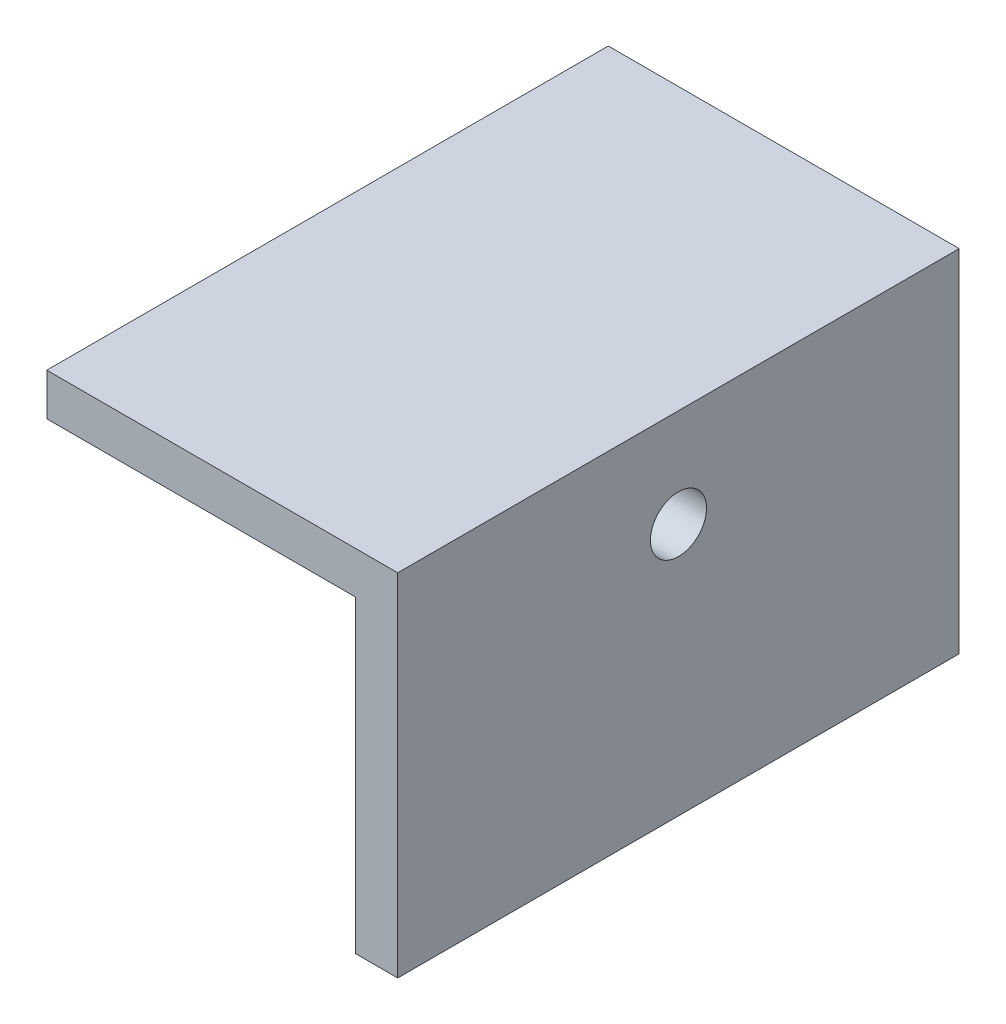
ISO-10303-21;
HEADER;
FILE_DESCRIPTION(('STEP AP214'),'2;1');
FILE_NAME('part.step','',(''),(''),'','','');
FILE_SCHEMA(('AUTOMOTIVE_DESIGN { 1 0 10303 214 1 1 1 1 }'));
ENDSEC;
DATA;
#1=APPLICATION_CONTEXT('core data for automotive mechanical design processes');
#2=APPLICATION_PROTOCOL_DEFINITION('international standard','automotive_design',2000,#1);
#3=PRODUCT_CONTEXT('',#1,'mechanical');
#4=PRODUCT('Part','Part','',(#3));
#5=PRODUCT_RELATED_PRODUCT_CATEGORY('part','',(#4));
#6=PRODUCT_DEFINITION_FORMATION('','',#4);
#7=PRODUCT_DEFINITION_CONTEXT('part definition',#1,'design');
#8=PRODUCT_DEFINITION('design','',#6,#7);
#9=PRODUCT_DEFINITION_SHAPE('','',#8);
#10=(LENGTH_UNIT() NAMED_UNIT(*) SI_UNIT(.MILLI.,.METRE.));
#11=(NAMED_UNIT(*) PLANE_ANGLE_UNIT() SI_UNIT($,.RADIAN.));
#12=(NAMED_UNIT(*) SI_UNIT($,.STERADIAN.) SOLID_ANGLE_UNIT());
#13=UNCERTAINTY_MEASURE_WITH_UNIT(LENGTH_MEASURE(1.E-05),#10,'distance_accuracy_value','');
#14=(GEOMETRIC_REPRESENTATION_CONTEXT(3) GLOBAL_UNCERTAINTY_ASSIGNED_CONTEXT((#13)) GLOBAL_UNIT_ASSIGNED_CONTEXT((#10,
#11,#12)) REPRESENTATION_CONTEXT('',''));
#15=CARTESIAN_POINT('',(0.,0.,0.));
#16=DIRECTION('',(0.,0.,1.));
#17=DIRECTION('',(1.,0.,0.));
#18=AXIS2_PLACEMENT_3D('',#15,#16,#17);
#19=CARTESIAN_POINT('',(80.,91.,0.));
#20=DIRECTION('',(-1.,0.,0.));
#21=DIRECTION('',(0.,0.,1.));
#22=AXIS2_PLACEMENT_3D('',#19,#20,#21);
#23=PLANE('',#22);
#24=DIRECTION('',(0.,0.,1.));
#25=VECTOR('',#24,1.);
#26=CARTESIAN_POINT('',(80.,94.,0.));
#27=LINE('',#26,#25);
#28=CARTESIAN_POINT('',(80.,94.,75.0847246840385));
#29=VERTEX_POINT('',#28);
#30=CARTESIAN_POINT('',(80.,94.,115.084724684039));
#31=VERTEX_POINT('',#30);
#32=EDGE_CURVE('E77',#29,#31,#27,.T.);
#33=ORIENTED_EDGE('',*,*,#32,.F.);
#34=DIRECTION('',(0.,1.,0.));
#35=VECTOR('',#34,1.);
#36=CARTESIAN_POINT('',(80.,91.,75.0847246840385));
#37=LINE('',#36,#35);
#38=CARTESIAN_POINT('',(80.,91.,75.0847246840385));
#39=VERTEX_POINT('',#38);
#40=EDGE_CURVE('E11',#39,#29,#37,.T.);
#41=ORIENTED_EDGE('',*,*,#40,.F.);
#42=DIRECTION('',(0.,0.,1.));
#43=VECTOR('',#42,1.);
#44=CARTESIAN_POINT('',(80.,91.,0.));
#45=LINE('',#44,#43);
#46=CARTESIAN_POINT('',(80.,91.,115.084724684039));
#47=VERTEX_POINT('',#46);
#48=EDGE_CURVE('E79',#39,#47,#45,.T.);
#49=ORIENTED_EDGE('',*,*,#48,.T.);
#50=DIRECTION('',(0.,1.,0.));
#51=VECTOR('',#50,1.);
#52=CARTESIAN_POINT('',(80.,91.,115.084724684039));
#53=LINE('',#52,#51);
#54=EDGE_CURVE('E73',#47,#31,#53,.T.);
#55=ORIENTED_EDGE('',*,*,#54,.T.);
#56=EDGE_LOOP('',(#33,#41,#49,#55));
#57=FACE_BOUND('',#56,.T.);
#58=ADVANCED_FACE('F35',(#57),#23,.T.);
#59=CARTESIAN_POINT('',(0.,91.,75.0847246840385));
#60=DIRECTION('',(0.,0.,-1.));
#61=DIRECTION('',(-1.,0.,0.));
#62=AXIS2_PLACEMENT_3D('',#59,#60,#61);
#63=PLANE('',#62);
#64=DIRECTION('',(-1.,0.,0.));
#65=VECTOR('',#64,1.);
#66=CARTESIAN_POINT('',(0.,94.,75.0847246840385));
#67=LINE('',#66,#65);
#68=CARTESIAN_POINT('',(105.,94.,75.0847246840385));
#69=VERTEX_POINT('',#68);
#70=EDGE_CURVE('E95',#69,#29,#67,.T.);
#71=ORIENTED_EDGE('',*,*,#70,.F.);
#72=DIRECTION('',(0.,1.,0.));
#73=VECTOR('',#72,1.);
#74=CARTESIAN_POINT('',(105.,91.,75.0847246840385));
#75=LINE('',#74,#73);
#76=CARTESIAN_POINT('',(105.,69.,75.0847246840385));
#77=VERTEX_POINT('',#76);
#78=EDGE_CURVE('E42',#77,#69,#75,.T.);
#79=ORIENTED_EDGE('',*,*,#78,.F.);
#80=DIRECTION('',(1.,0.,0.));
#81=VECTOR('',#80,1.);
#82=CARTESIAN_POINT('',(105.,69.,75.0847246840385));
#83=LINE('',#82,#81);
#84=CARTESIAN_POINT('',(102.,69.,75.0847246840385));
#85=VERTEX_POINT('',#84);
#86=EDGE_CURVE('E123',#85,#77,#83,.T.);
#87=ORIENTED_EDGE('',*,*,#86,.F.);
#88=DIRECTION('',(0.,1.,0.));
#89=VECTOR('',#88,1.);
#90=CARTESIAN_POINT('',(102.,69.,75.0847246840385));
#91=LINE('',#90,#89);
#92=CARTESIAN_POINT('',(102.,91.,75.0847246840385));
#93=VERTEX_POINT('',#92);
#94=EDGE_CURVE('E100',#85,#93,#91,.T.);
#95=ORIENTED_EDGE('',*,*,#94,.T.);
#96=DIRECTION('',(-1.,0.,0.));
#97=VECTOR('',#96,1.);
#98=CARTESIAN_POINT('',(0.,91.,75.0847246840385));
#99=LINE('',#98,#97);
#100=EDGE_CURVE('E117',#93,#39,#99,.T.);
#101=ORIENTED_EDGE('',*,*,#100,.T.);
#102=ORIENTED_EDGE('',*,*,#40,.T.);
#103=EDGE_LOOP('',(#71,#79,#87,#95,#101,#102));
#104=FACE_BOUND('',#103,.T.);
#105=ADVANCED_FACE('F115',(#104),#63,.T.);
#106=CARTESIAN_POINT('',(105.,91.,0.));
#107=DIRECTION('',(-1.,0.,0.));
#108=DIRECTION('',(0.,0.,1.));
#109=AXIS2_PLACEMENT_3D('',#106,#107,#108);
#110=PLANE('',#109);
#111=CARTESIAN_POINT('',(105.,87.,95.0847246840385));
#112=DIRECTION('',(-1.,0.,0.));
#113=DIRECTION('',(0.,0.,1.));
#114=AXIS2_PLACEMENT_3D('',#111,#112,#113);
#115=CIRCLE('',#114,2.);
#116=CARTESIAN_POINT('',(105.,87.,97.0847246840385));
#117=VERTEX_POINT('',#116);
#118=EDGE_CURVE('E125',#117,#117,#115,.F.);
#119=ORIENTED_EDGE('',*,*,#118,.F.);
#120=EDGE_LOOP('',(#119));
#121=FACE_BOUND('',#120,.T.);
#122=DIRECTION('',(0.,0.,1.));
#123=VECTOR('',#122,1.);
#124=CARTESIAN_POINT('',(105.,94.,0.));
#125=LINE('',#124,#123);
#126=CARTESIAN_POINT('',(105.,94.,115.084724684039));
#127=VERTEX_POINT('',#126);
#128=EDGE_CURVE('E91',#69,#127,#125,.T.);
#129=ORIENTED_EDGE('',*,*,#128,.T.);
#130=DIRECTION('',(0.,1.,0.));
#131=VECTOR('',#130,1.);
#132=CARTESIAN_POINT('',(105.,91.,115.084724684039));
#133=LINE('',#132,#131);
#134=CARTESIAN_POINT('',(105.,69.,115.084724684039));
#135=VERTEX_POINT('',#134);
#136=EDGE_CURVE('E81',#135,#127,#133,.T.);
#137=ORIENTED_EDGE('',*,*,#136,.F.);
#138=DIRECTION('',(0.,0.,1.));
#139=VECTOR('',#138,1.);
#140=CARTESIAN_POINT('',(105.,69.,75.0847246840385));
#141=LINE('',#140,#139);
#142=EDGE_CURVE('E111',#77,#135,#141,.T.);
#143=ORIENTED_EDGE('',*,*,#142,.F.);
#144=ORIENTED_EDGE('',*,*,#78,.T.);
#145=EDGE_LOOP('',(#129,#137,#143,#144));
#146=FACE_BOUND('',#145,.T.);
#147=ADVANCED_FACE('F109',(#121,#146),#110,.F.);
#148=CARTESIAN_POINT('',(0.,91.,115.084724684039));
#149=DIRECTION('',(0.,0.,-1.));
#150=DIRECTION('',(-1.,0.,0.));
#151=AXIS2_PLACEMENT_3D('',#148,#149,#150);
#152=PLANE('',#151);
#153=DIRECTION('',(-1.,0.,0.));
#154=VECTOR('',#153,1.);
#155=CARTESIAN_POINT('',(0.,94.,115.084724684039));
#156=LINE('',#155,#154);
#157=EDGE_CURVE('E85',#127,#31,#156,.T.);
#158=ORIENTED_EDGE('',*,*,#157,.T.);
#159=ORIENTED_EDGE('',*,*,#54,.F.);
#160=DIRECTION('',(-1.,0.,0.));
#161=VECTOR('',#160,1.);
#162=CARTESIAN_POINT('',(0.,91.,115.084724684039));
#163=LINE('',#162,#161);
#164=CARTESIAN_POINT('',(102.,91.,115.084724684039));
#165=VERTEX_POINT('',#164);
#166=EDGE_CURVE('E54',#165,#47,#163,.T.);
#167=ORIENTED_EDGE('',*,*,#166,.F.);
#168=DIRECTION('',(0.,1.,0.));
#169=VECTOR('',#168,1.);
#170=CARTESIAN_POINT('',(102.,69.,115.084724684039));
#171=LINE('',#170,#169);
#172=CARTESIAN_POINT('',(102.,69.,115.084724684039));
#173=VERTEX_POINT('',#172);
#174=EDGE_CURVE('E96',#173,#165,#171,.T.);
#175=ORIENTED_EDGE('',*,*,#174,.F.);
#176=DIRECTION('',(-1.,0.,0.));
#177=VECTOR('',#176,1.);
#178=CARTESIAN_POINT('',(105.,69.,115.084724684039));
#179=LINE('',#178,#177);
#180=EDGE_CURVE('E130',#135,#173,#179,.T.);
#181=ORIENTED_EDGE('',*,*,#180,.F.);
#182=ORIENTED_EDGE('',*,*,#136,.T.);
#183=EDGE_LOOP('',(#158,#159,#167,#175,#181,#182));
#184=FACE_BOUND('',#183,.T.);
#185=ADVANCED_FACE('F86',(#184),#152,.F.);
#186=CARTESIAN_POINT('',(0.,91.,0.));
#187=DIRECTION('',(0.,-1.,0.));
#188=DIRECTION('',(0.,0.,-1.));
#189=AXIS2_PLACEMENT_3D('',#186,#187,#188);
#190=PLANE('',#189);
#191=DIRECTION('',(0.,0.,-1.));
#192=VECTOR('',#191,1.);
#193=CARTESIAN_POINT('',(102.,91.,75.0847246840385));
#194=LINE('',#193,#192);
#195=EDGE_CURVE('E49',#165,#93,#194,.T.);
#196=ORIENTED_EDGE('',*,*,#195,.F.);
#197=ORIENTED_EDGE('',*,*,#166,.T.);
#198=ORIENTED_EDGE('',*,*,#48,.F.);
#199=ORIENTED_EDGE('',*,*,#100,.F.);
#200=EDGE_LOOP('',(#196,#197,#198,#199));
#201=FACE_BOUND('',#200,.T.);
#202=ADVANCED_FACE('F118',(#201),#190,.T.);
#203=CARTESIAN_POINT('',(0.,94.,0.));
#204=DIRECTION('',(0.,-1.,0.));
#205=DIRECTION('',(0.,0.,-1.));
#206=AXIS2_PLACEMENT_3D('',#203,#204,#205);
#207=PLANE('',#206);
#208=ORIENTED_EDGE('',*,*,#32,.T.);
#209=ORIENTED_EDGE('',*,*,#157,.F.);
#210=ORIENTED_EDGE('',*,*,#128,.F.);
#211=ORIENTED_EDGE('',*,*,#70,.T.);
#212=EDGE_LOOP('',(#208,#209,#210,#211));
#213=FACE_BOUND('',#212,.T.);
#214=ADVANCED_FACE('F93',(#213),#207,.F.);
#215=CARTESIAN_POINT('',(102.,69.,75.0847246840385));
#216=DIRECTION('',(1.,0.,0.));
#217=DIRECTION('',(0.,0.,-1.));
#218=AXIS2_PLACEMENT_3D('',#215,#216,#217);
#219=PLANE('',#218);
#220=CARTESIAN_POINT('',(102.,87.,95.0847246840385));
#221=DIRECTION('',(-1.,0.,0.));
#222=DIRECTION('',(0.,0.,1.));
#223=AXIS2_PLACEMENT_3D('',#220,#221,#222);
#224=CIRCLE('',#223,2.);
#225=CARTESIAN_POINT('',(102.,87.,97.0847246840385));
#226=VERTEX_POINT('',#225);
#227=EDGE_CURVE('E136',#226,#226,#224,.T.);
#228=ORIENTED_EDGE('',*,*,#227,.F.);
#229=EDGE_LOOP('',(#228));
#230=FACE_BOUND('',#229,.T.);
#231=ORIENTED_EDGE('',*,*,#195,.T.);
#232=ORIENTED_EDGE('',*,*,#94,.F.);
#233=DIRECTION('',(0.,0.,-1.));
#234=VECTOR('',#233,1.);
#235=CARTESIAN_POINT('',(102.,69.,75.0847246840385));
#236=LINE('',#235,#234);
#237=EDGE_CURVE('E127',#173,#85,#236,.T.);
#238=ORIENTED_EDGE('',*,*,#237,.F.);
#239=ORIENTED_EDGE('',*,*,#174,.T.);
#240=EDGE_LOOP('',(#231,#232,#238,#239));
#241=FACE_BOUND('',#240,.T.);
#242=ADVANCED_FACE('F143',(#230,#241),#219,.F.);
#243=CARTESIAN_POINT('',(0.,69.,0.));
#244=DIRECTION('',(0.,-1.,0.));
#245=DIRECTION('',(0.,0.,-1.));
#246=AXIS2_PLACEMENT_3D('',#243,#244,#245);
#247=PLANE('',#246);
#248=ORIENTED_EDGE('',*,*,#142,.T.);
#249=ORIENTED_EDGE('',*,*,#180,.T.);
#250=ORIENTED_EDGE('',*,*,#237,.T.);
#251=ORIENTED_EDGE('',*,*,#86,.T.);
#252=EDGE_LOOP('',(#248,#249,#250,#251));
#253=FACE_BOUND('',#252,.T.);
#254=ADVANCED_FACE('F146',(#253),#247,.T.);
#255=CARTESIAN_POINT('',(111.611966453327,87.,95.0847246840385));
#256=DIRECTION('',(-1.,0.,0.));
#257=DIRECTION('',(0.,0.,1.));
#258=AXIS2_PLACEMENT_3D('',#255,#256,#257);
#259=CYLINDRICAL_SURFACE('',#258,2.);
#260=ORIENTED_EDGE('',*,*,#227,.T.);
#261=EDGE_LOOP('',(#260));
#262=FACE_BOUND('',#261,.T.);
#263=ORIENTED_EDGE('',*,*,#118,.T.);
#264=EDGE_LOOP('',(#263));
#265=FACE_BOUND('',#264,.T.);
#266=ADVANCED_FACE('F140',(#262,#265),#259,.F.);
#267=CLOSED_SHELL('',(#58,#105,#147,#185,#202,#214,#242,#254,#266));
#268=MANIFOLD_SOLID_BREP('B2',#267);
#269=ADVANCED_BREP_SHAPE_REPRESENTATION('',(#18,#268),#14);
#270=SHAPE_DEFINITION_REPRESENTATION(#9,#269);
ENDSEC;
END-ISO-10303-21;
